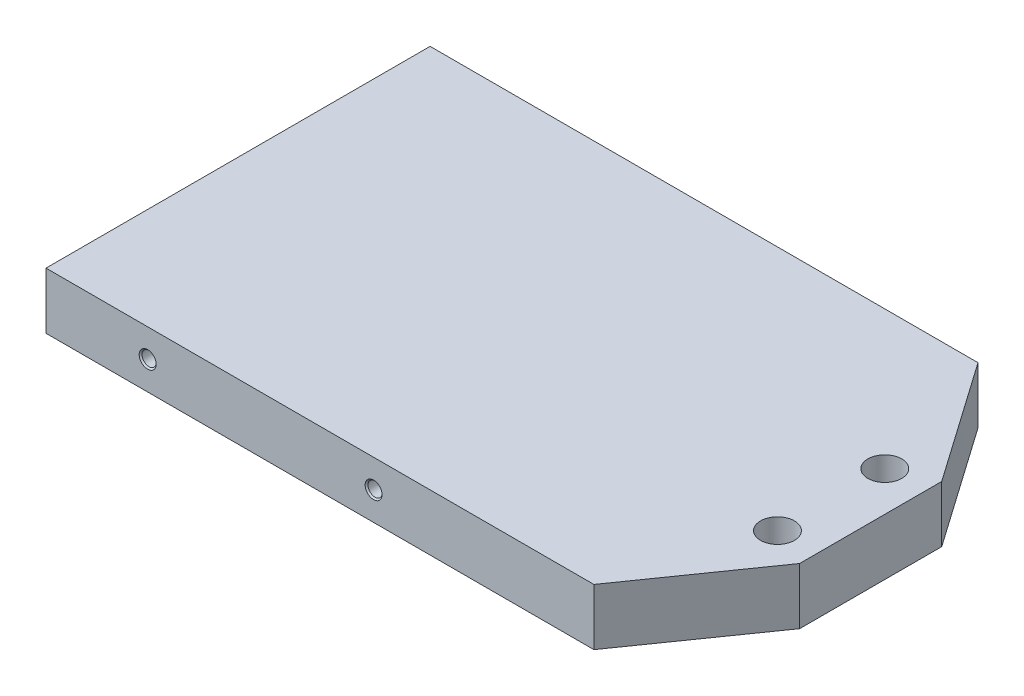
from build123d import *

# Parameters (mm, degrees)
ESQUISSE1_W                = 112
ESQUISSE1_H                = 10
EXTRUSION1_DEPTH           = 34
R_P_TITION_LIN_AIRE1_COUNT = 2
R_P_TITION_LIN_AIRE1_PITCH = 58
R_P_TITION_LIN_AIRE2_COUNT = 2
R_P_TITION_LIN_AIRE2_PITCH = 45
R_P_TITION_LIN_AIRE3_COUNT = 2
R_P_TITION_LIN_AIRE3_PITCH = 19
ENL_V_MAT_EXTRU_1_DEPTH    = 118.473401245
R_P_TITION_LIN_AIRE4_COUNT = 2
R_P_TITION_LIN_AIRE4_PITCH = 40
R_P_TITION_LIN_AIRE5_COUNT = 2
R_P_TITION_LIN_AIRE5_PITCH = 40


with BuildPart() as part:
    # Esquisse1 → Extrusion1 (new, symmetric)
    with BuildSketch(Plane.XY):
        with Locations((56, 0)):
            Rectangle(ESQUISSE1_W, ESQUISSE1_H)
    extrude(amount=EXTRUSION1_DEPTH, both=True)

    # Esquisse2 → Trou taraud_ M5x0.81 (revolve, cut)
    with BuildSketch(Plane(origin=(0, 0, -29), x_dir=(0, 0, 1), z_dir=(0, 1, 0))):
        Polygon((0, 0), (0, 16.2618073), (2.1, 15), (2.1, 0.4), (2.5, 0), align=None)
    trou_taraud_m5x0_81 = revolve(axis=Axis((-6.35, 0, -29), (1, 0, 0)), mode=Mode.SUBTRACT)

    # R_p_tition lin_aire1: Trou taraud_ M5x0.81 ×2
    with Locations(*[(0, 0, i * R_P_TITION_LIN_AIRE1_PITCH) for i in range(1, R_P_TITION_LIN_AIRE1_COUNT)]):
        add(trou_taraud_m5x0_81, mode=Mode.SUBTRACT)

    # Esquisse6 → Diam_tre du per_age M5.0 _5.000000_1 (revolve, cut)
    with BuildSketch(Plane(origin=(0, 0, -22.5), x_dir=(0, 0, 1), z_dir=(0, 1, 0))):
        Polygon((0, 0), (0, 13.502151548), (2.5, 12), (2.5, 0.5), (3, 0), align=None)
    diam_tre_du_per_age_m5_0_5_000000_1 = revolve(axis=Axis((-6.35, 0, -22.5), (1, 0, 0)), mode=Mode.SUBTRACT)

    # R_p_tition lin_aire2: Diam_tre du per_age M5.0 _5.000000_1 ×2
    with Locations(*[(0, 0, i * R_P_TITION_LIN_AIRE2_PITCH) for i in range(1, R_P_TITION_LIN_AIRE2_COUNT)]):
        add(diam_tre_du_per_age_m5_0_5_000000_1, mode=Mode.SUBTRACT)

    # Esquisse7 → Chambrage pour vis _ t_te hexagonale M61 (revolve, cut)
    with BuildSketch(Plane(origin=(105, -5, -9.5), x_dir=(0, 0, -1), z_dir=(1, 0, 0))):
        Polygon((0, 0), (0, 10), (3, 10), (3, 5.2), (5.5, 5.2), (5.5, 0.5), (6, 0), align=None)
    chambrage_pour_vis_t_te_hexagonale_m61 = revolve(axis=Axis((105, -11.35, -9.5), (0, 1, 0)), mode=Mode.SUBTRACT)

    # R_p_tition lin_aire3: Chambrage pour vis _ t_te hexagonale M61 ×2
    with Locations(*[(0, 0, i * R_P_TITION_LIN_AIRE3_PITCH) for i in range(1, R_P_TITION_LIN_AIRE3_COUNT)]):
        add(chambrage_pour_vis_t_te_hexagonale_m61, mode=Mode.SUBTRACT)

    # Esquisse8 → Enl_v. mat.-Extru.1 (cut, symmetric)
    with BuildSketch(Plane.XZ.offset(5)):
        Polygon((-47.884460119, -240.916452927), (97, -34), (112, -12.577779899), (256.884460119, 194.338673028), (670.717365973, -95.43024721), (365.948445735, -530.685373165), align=None)
    enl_v_mat_extru_1 = extrude(amount=ENL_V_MAT_EXTRU_1_DEPTH, both=True, mode=Mode.SUBTRACT)

    # Sym_trie1: Enl_v. mat.-Extru.1 across plane
    add(enl_v_mat_extru_1.mirror(Plane.XY), mode=Mode.SUBTRACT)

    # Esquisse9 → Trou taraud_ M3x0.51 (revolve, cut)
    with BuildSketch(Plane(origin=(18, 0, 34), x_dir=(0, -1, 0), z_dir=(1, 0, 0))):
        Polygon((0, 0), (0, 10.751075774), (1.25, 10), (1.25, 0.25), (1.5, 0), align=None)
    trou_taraud_m3x0_51 = revolve(axis=Axis((18, 0, 40.35), (0, 0, -1)), mode=Mode.SUBTRACT)

    # R_p_tition lin_aire4: Trou taraud_ M3x0.51 ×2
    with Locations(*[(i * R_P_TITION_LIN_AIRE4_PITCH, 0, 0) for i in range(1, R_P_TITION_LIN_AIRE4_COUNT)]):
        add(trou_taraud_m3x0_51, mode=Mode.SUBTRACT)

    # Esquisse12 → Trou taraud_ M3x0.52 (revolve, cut)
    with BuildSketch(Plane(origin=(18, 0, -34), x_dir=(0, 1, 0), z_dir=(1, 0, 0))):
        Polygon((0, 0), (0, 10.751075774), (1.25, 10), (1.25, 0.25), (1.5, 0), align=None)
    trou_taraud_m3x0_52 = revolve(axis=Axis((18, 0, -40.35), (0, 0, 1)), mode=Mode.SUBTRACT)

    # R_p_tition lin_aire5: Trou taraud_ M3x0.52 ×2
    with Locations(*[(i * R_P_TITION_LIN_AIRE5_PITCH, 0, 0) for i in range(1, R_P_TITION_LIN_AIRE5_COUNT)]):
        add(trou_taraud_m3x0_52, mode=Mode.SUBTRACT)


solid = part.part
